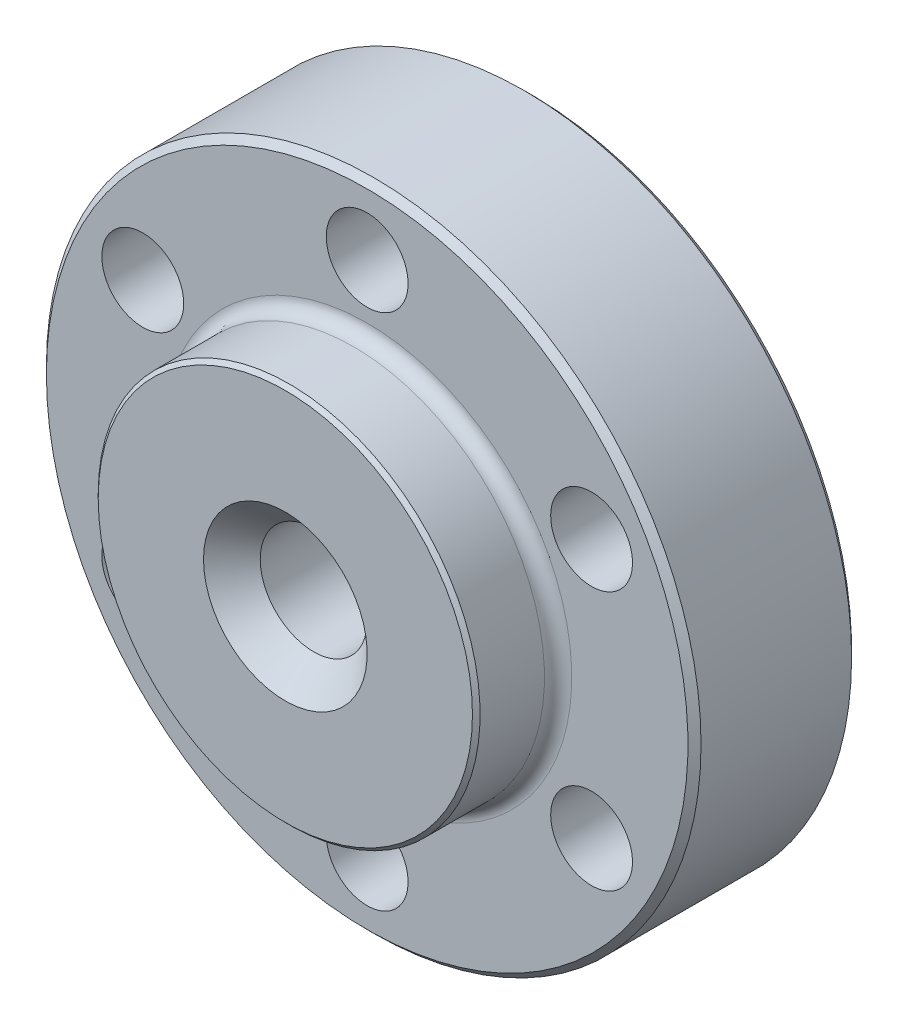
ISO-10303-21;
HEADER;
FILE_DESCRIPTION(('STEP AP214'),'2;1');
FILE_NAME('part.step','',(''),(''),'','','');
FILE_SCHEMA(('AUTOMOTIVE_DESIGN { 1 0 10303 214 1 1 1 1 }'));
ENDSEC;
DATA;
#1=APPLICATION_CONTEXT('core data for automotive mechanical design processes');
#2=APPLICATION_PROTOCOL_DEFINITION('international standard','automotive_design',2000,#1);
#3=PRODUCT_CONTEXT('',#1,'mechanical');
#4=PRODUCT('Part','Part','',(#3));
#5=PRODUCT_RELATED_PRODUCT_CATEGORY('part','',(#4));
#6=PRODUCT_DEFINITION_FORMATION('','',#4);
#7=PRODUCT_DEFINITION_CONTEXT('part definition',#1,'design');
#8=PRODUCT_DEFINITION('design','',#6,#7);
#9=PRODUCT_DEFINITION_SHAPE('','',#8);
#10=(LENGTH_UNIT() NAMED_UNIT(*) SI_UNIT(.MILLI.,.METRE.));
#11=(NAMED_UNIT(*) PLANE_ANGLE_UNIT() SI_UNIT($,.RADIAN.));
#12=(NAMED_UNIT(*) SI_UNIT($,.STERADIAN.) SOLID_ANGLE_UNIT());
#13=UNCERTAINTY_MEASURE_WITH_UNIT(LENGTH_MEASURE(1.E-05),#10,'distance_accuracy_value','');
#14=(GEOMETRIC_REPRESENTATION_CONTEXT(3) GLOBAL_UNCERTAINTY_ASSIGNED_CONTEXT((#13)) GLOBAL_UNIT_ASSIGNED_CONTEXT((#10,
#11,#12)) REPRESENTATION_CONTEXT('',''));
#15=CARTESIAN_POINT('',(0.,0.,0.));
#16=DIRECTION('',(0.,0.,1.));
#17=DIRECTION('',(1.,0.,0.));
#18=AXIS2_PLACEMENT_3D('',#15,#16,#17);
#19=CARTESIAN_POINT('',(0.,23.52,0.));
#20=DIRECTION('',(0.,0.,1.));
#21=DIRECTION('',(1.,0.,0.));
#22=AXIS2_PLACEMENT_3D('',#19,#20,#21);
#23=PLANE('',#22);
#24=CARTESIAN_POINT('',(16.4544826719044,9.5,0.));
#25=DIRECTION('',(0.,0.,1.));
#26=DIRECTION('',(1.,0.,0.));
#27=AXIS2_PLACEMENT_3D('',#24,#25,#26);
#28=CIRCLE('',#27,3.);
#29=CARTESIAN_POINT('',(19.4544826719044,9.5,0.));
#30=VERTEX_POINT('',#29);
#31=EDGE_CURVE('E58',#30,#30,#28,.T.);
#32=ORIENTED_EDGE('',*,*,#31,.T.);
#33=EDGE_LOOP('',(#32));
#34=FACE_BOUND('',#33,.T.);
#35=CARTESIAN_POINT('',(16.4544826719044,-9.5,0.));
#36=DIRECTION('',(0.,0.,1.));
#37=DIRECTION('',(1.,0.,0.));
#38=AXIS2_PLACEMENT_3D('',#35,#36,#37);
#39=CIRCLE('',#38,3.);
#40=CARTESIAN_POINT('',(19.4544826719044,-9.5,0.));
#41=VERTEX_POINT('',#40);
#42=EDGE_CURVE('E54',#41,#41,#39,.T.);
#43=ORIENTED_EDGE('',*,*,#42,.T.);
#44=EDGE_LOOP('',(#43));
#45=FACE_BOUND('',#44,.T.);
#46=CARTESIAN_POINT('',(0.,-19.,0.));
#47=DIRECTION('',(0.,0.,1.));
#48=DIRECTION('',(1.,0.,0.));
#49=AXIS2_PLACEMENT_3D('',#46,#47,#48);
#50=CIRCLE('',#49,3.);
#51=CARTESIAN_POINT('',(3.,-19.,0.));
#52=VERTEX_POINT('',#51);
#53=EDGE_CURVE('E50',#52,#52,#50,.T.);
#54=ORIENTED_EDGE('',*,*,#53,.T.);
#55=EDGE_LOOP('',(#54));
#56=FACE_BOUND('',#55,.T.);
#57=CARTESIAN_POINT('',(-16.4544826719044,-9.5,0.));
#58=DIRECTION('',(0.,0.,1.));
#59=DIRECTION('',(1.,0.,0.));
#60=AXIS2_PLACEMENT_3D('',#57,#58,#59);
#61=CIRCLE('',#60,3.);
#62=CARTESIAN_POINT('',(-13.4544826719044,-9.5,0.));
#63=VERTEX_POINT('',#62);
#64=EDGE_CURVE('E45',#63,#63,#61,.T.);
#65=ORIENTED_EDGE('',*,*,#64,.T.);
#66=EDGE_LOOP('',(#65));
#67=FACE_BOUND('',#66,.T.);
#68=CARTESIAN_POINT('',(-16.4544826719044,9.5,0.));
#69=DIRECTION('',(0.,0.,1.));
#70=DIRECTION('',(1.,0.,0.));
#71=AXIS2_PLACEMENT_3D('',#68,#69,#70);
#72=CIRCLE('',#71,3.);
#73=CARTESIAN_POINT('',(-13.4544826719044,9.5,0.));
#74=VERTEX_POINT('',#73);
#75=EDGE_CURVE('E40',#74,#74,#72,.T.);
#76=ORIENTED_EDGE('',*,*,#75,.T.);
#77=EDGE_LOOP('',(#76));
#78=FACE_BOUND('',#77,.T.);
#79=CARTESIAN_POINT('',(0.,19.,0.));
#80=DIRECTION('',(0.,0.,1.));
#81=DIRECTION('',(1.,0.,0.));
#82=AXIS2_PLACEMENT_3D('',#79,#80,#81);
#83=CIRCLE('',#82,3.);
#84=CARTESIAN_POINT('',(3.,19.,0.));
#85=VERTEX_POINT('',#84);
#86=EDGE_CURVE('E39',#85,#85,#83,.T.);
#87=ORIENTED_EDGE('',*,*,#86,.T.);
#88=EDGE_LOOP('',(#87));
#89=FACE_BOUND('',#88,.T.);
#90=CARTESIAN_POINT('',(0.,0.,0.));
#91=DIRECTION('',(0.,0.,-1.));
#92=DIRECTION('',(-1.,0.,0.));
#93=AXIS2_PLACEMENT_3D('',#90,#91,#92);
#94=CIRCLE('',#93,23.52);
#95=CARTESIAN_POINT('',(-23.52,0.,0.));
#96=VERTEX_POINT('',#95);
#97=EDGE_CURVE('E8',#96,#96,#94,.T.);
#98=ORIENTED_EDGE('',*,*,#97,.T.);
#99=EDGE_LOOP('',(#98));
#100=FACE_BOUND('',#99,.T.);
#101=CARTESIAN_POINT('',(0.,0.,0.));
#102=DIRECTION('',(0.,0.,-1.));
#103=DIRECTION('',(-1.,0.,0.));
#104=AXIS2_PLACEMENT_3D('',#101,#102,#103);
#105=CIRCLE('',#104,6.);
#106=CARTESIAN_POINT('',(-6.,0.,0.));
#107=VERTEX_POINT('',#106);
#108=EDGE_CURVE('E86',#107,#107,#105,.T.);
#109=ORIENTED_EDGE('',*,*,#108,.F.);
#110=EDGE_LOOP('',(#109));
#111=FACE_BOUND('',#110,.T.);
#112=ADVANCED_FACE('F12',(#34,#45,#56,#67,#78,#89,#100,#111),#23,.F.);
#113=CARTESIAN_POINT('',(0.,0.,18.));
#114=DIRECTION('',(0.,0.,-1.));
#115=DIRECTION('',(-1.,0.,0.));
#116=AXIS2_PLACEMENT_3D('',#113,#114,#115);
#117=PLANE('',#116);
#118=CARTESIAN_POINT('',(0.,0.,18.));
#119=DIRECTION('',(0.,0.,-1.));
#120=DIRECTION('',(-1.,0.,0.));
#121=AXIS2_PLACEMENT_3D('',#118,#119,#120);
#122=CIRCLE('',#121,13.72);
#123=CARTESIAN_POINT('',(-13.72,0.,18.));
#124=VERTEX_POINT('',#123);
#125=EDGE_CURVE('E21',#124,#124,#122,.T.);
#126=ORIENTED_EDGE('',*,*,#125,.F.);
#127=EDGE_LOOP('',(#126));
#128=FACE_BOUND('',#127,.T.);
#129=CARTESIAN_POINT('',(0.,0.,18.));
#130=DIRECTION('',(0.,0.,-1.));
#131=DIRECTION('',(-1.,0.,0.));
#132=AXIS2_PLACEMENT_3D('',#129,#130,#131);
#133=CIRCLE('',#132,6.);
#134=CARTESIAN_POINT('',(-6.,0.,18.));
#135=VERTEX_POINT('',#134);
#136=EDGE_CURVE('E97',#135,#135,#133,.T.);
#137=ORIENTED_EDGE('',*,*,#136,.T.);
#138=EDGE_LOOP('',(#137));
#139=FACE_BOUND('',#138,.T.);
#140=ADVANCED_FACE('F135',(#128,#139),#117,.F.);
#141=CARTESIAN_POINT('',(0.,0.,0.48));
#142=DIRECTION('',(0.,0.,1.));
#143=DIRECTION('',(1.,0.,0.));
#144=AXIS2_PLACEMENT_3D('',#141,#142,#143);
#145=CONICAL_SURFACE('',#144,24.,0.785398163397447);
#146=ORIENTED_EDGE('',*,*,#97,.F.);
#147=EDGE_LOOP('',(#146));
#148=FACE_BOUND('',#147,.T.);
#149=CARTESIAN_POINT('',(0.,0.,0.48));
#150=DIRECTION('',(0.,0.,-1.));
#151=DIRECTION('',(-1.,0.,0.));
#152=AXIS2_PLACEMENT_3D('',#149,#150,#151);
#153=CIRCLE('',#152,24.);
#154=CARTESIAN_POINT('',(-24.,0.,0.480000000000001));
#155=VERTEX_POINT('',#154);
#156=EDGE_CURVE('E101',#155,#155,#153,.T.);
#157=ORIENTED_EDGE('',*,*,#156,.T.);
#158=EDGE_LOOP('',(#157));
#159=FACE_BOUND('',#158,.T.);
#160=ADVANCED_FACE('F14',(#148,#159),#145,.T.);
#161=CARTESIAN_POINT('',(0.,0.,18.));
#162=DIRECTION('',(0.,0.,-1.));
#163=DIRECTION('',(-1.,0.,0.));
#164=AXIS2_PLACEMENT_3D('',#161,#162,#163);
#165=CONICAL_SURFACE('',#164,13.72,0.785398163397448);
#166=CARTESIAN_POINT('',(0.,0.,17.72));
#167=DIRECTION('',(0.,0.,-1.));
#168=DIRECTION('',(-1.,0.,0.));
#169=AXIS2_PLACEMENT_3D('',#166,#167,#168);
#170=CIRCLE('',#169,14.);
#171=CARTESIAN_POINT('',(-14.,0.,17.72));
#172=VERTEX_POINT('',#171);
#173=EDGE_CURVE('E31',#172,#172,#170,.T.);
#174=ORIENTED_EDGE('',*,*,#173,.F.);
#175=EDGE_LOOP('',(#174));
#176=FACE_BOUND('',#175,.T.);
#177=ORIENTED_EDGE('',*,*,#125,.T.);
#178=EDGE_LOOP('',(#177));
#179=FACE_BOUND('',#178,.T.);
#180=ADVANCED_FACE('F129',(#176,#179),#165,.T.);
#181=CARTESIAN_POINT('',(0.,0.,0.));
#182=DIRECTION('',(0.,0.,-1.));
#183=DIRECTION('',(-1.,0.,0.));
#184=AXIS2_PLACEMENT_3D('',#181,#182,#183);
#185=CYLINDRICAL_SURFACE('',#184,14.);
#186=CARTESIAN_POINT('',(0.,0.,13.));
#187=DIRECTION('',(0.,0.,-1.));
#188=DIRECTION('',(-1.,0.,0.));
#189=AXIS2_PLACEMENT_3D('',#186,#187,#188);
#190=CIRCLE('',#189,14.);
#191=CARTESIAN_POINT('',(-14.,0.,13.));
#192=VERTEX_POINT('',#191);
#193=EDGE_CURVE('E117',#192,#192,#190,.T.);
#194=ORIENTED_EDGE('',*,*,#193,.F.);
#195=EDGE_LOOP('',(#194));
#196=FACE_BOUND('',#195,.T.);
#197=ORIENTED_EDGE('',*,*,#173,.T.);
#198=EDGE_LOOP('',(#197));
#199=FACE_BOUND('',#198,.T.);
#200=ADVANCED_FACE('F127',(#196,#199),#185,.T.);
#201=CARTESIAN_POINT('',(0.,0.,13.));
#202=DIRECTION('',(0.,0.,-1.));
#203=DIRECTION('',(-1.,0.,0.));
#204=AXIS2_PLACEMENT_3D('',#201,#202,#203);
#205=TOROIDAL_SURFACE('',#204,15.,1.);
#206=ORIENTED_EDGE('',*,*,#193,.T.);
#207=EDGE_LOOP('',(#206));
#208=FACE_BOUND('',#207,.T.);
#209=CARTESIAN_POINT('',(0.,0.,12.));
#210=DIRECTION('',(0.,0.,-1.));
#211=DIRECTION('',(-1.,0.,0.));
#212=AXIS2_PLACEMENT_3D('',#209,#210,#211);
#213=CIRCLE('',#212,15.);
#214=CARTESIAN_POINT('',(-15.,0.,12.));
#215=VERTEX_POINT('',#214);
#216=EDGE_CURVE('E113',#215,#215,#213,.T.);
#217=ORIENTED_EDGE('',*,*,#216,.F.);
#218=EDGE_LOOP('',(#217));
#219=FACE_BOUND('',#218,.T.);
#220=ADVANCED_FACE('F165',(#208,#219),#205,.F.);
#221=CARTESIAN_POINT('',(0.,15.,12.));
#222=DIRECTION('',(0.,0.,-1.));
#223=DIRECTION('',(-1.,0.,0.));
#224=AXIS2_PLACEMENT_3D('',#221,#222,#223);
#225=PLANE('',#224);
#226=CARTESIAN_POINT('',(16.4544826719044,9.5,12.));
#227=DIRECTION('',(0.,0.,-1.));
#228=DIRECTION('',(-1.,0.,0.));
#229=AXIS2_PLACEMENT_3D('',#226,#227,#228);
#230=CIRCLE('',#229,3.);
#231=CARTESIAN_POINT('',(13.4544826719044,9.5,12.));
#232=VERTEX_POINT('',#231);
#233=EDGE_CURVE('E16',#232,#232,#230,.T.);
#234=ORIENTED_EDGE('',*,*,#233,.T.);
#235=EDGE_LOOP('',(#234));
#236=FACE_BOUND('',#235,.T.);
#237=CARTESIAN_POINT('',(16.4544826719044,-9.5,12.));
#238=DIRECTION('',(0.,0.,-1.));
#239=DIRECTION('',(-1.,0.,0.));
#240=AXIS2_PLACEMENT_3D('',#237,#238,#239);
#241=CIRCLE('',#240,3.);
#242=CARTESIAN_POINT('',(13.4544826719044,-9.5,12.));
#243=VERTEX_POINT('',#242);
#244=EDGE_CURVE('E55',#243,#243,#241,.T.);
#245=ORIENTED_EDGE('',*,*,#244,.T.);
#246=EDGE_LOOP('',(#245));
#247=FACE_BOUND('',#246,.T.);
#248=CARTESIAN_POINT('',(0.,-19.,12.));
#249=DIRECTION('',(0.,0.,-1.));
#250=DIRECTION('',(-1.,0.,0.));
#251=AXIS2_PLACEMENT_3D('',#248,#249,#250);
#252=CIRCLE('',#251,3.);
#253=CARTESIAN_POINT('',(-3.,-19.,12.));
#254=VERTEX_POINT('',#253);
#255=EDGE_CURVE('E51',#254,#254,#252,.T.);
#256=ORIENTED_EDGE('',*,*,#255,.T.);
#257=EDGE_LOOP('',(#256));
#258=FACE_BOUND('',#257,.T.);
#259=CARTESIAN_POINT('',(-16.4544826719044,-9.5,12.));
#260=DIRECTION('',(0.,0.,-1.));
#261=DIRECTION('',(-1.,0.,0.));
#262=AXIS2_PLACEMENT_3D('',#259,#260,#261);
#263=CIRCLE('',#262,3.);
#264=CARTESIAN_POINT('',(-19.4544826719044,-9.5,12.));
#265=VERTEX_POINT('',#264);
#266=EDGE_CURVE('E46',#265,#265,#263,.T.);
#267=ORIENTED_EDGE('',*,*,#266,.T.);
#268=EDGE_LOOP('',(#267));
#269=FACE_BOUND('',#268,.T.);
#270=CARTESIAN_POINT('',(-16.4544826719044,9.5,12.));
#271=DIRECTION('',(0.,0.,-1.));
#272=DIRECTION('',(-1.,0.,0.));
#273=AXIS2_PLACEMENT_3D('',#270,#271,#272);
#274=CIRCLE('',#273,3.);
#275=CARTESIAN_POINT('',(-19.4544826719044,9.5,12.));
#276=VERTEX_POINT('',#275);
#277=EDGE_CURVE('E41',#276,#276,#274,.T.);
#278=ORIENTED_EDGE('',*,*,#277,.T.);
#279=EDGE_LOOP('',(#278));
#280=FACE_BOUND('',#279,.T.);
#281=CARTESIAN_POINT('',(0.,19.,12.));
#282=DIRECTION('',(0.,0.,-1.));
#283=DIRECTION('',(-1.,0.,0.));
#284=AXIS2_PLACEMENT_3D('',#281,#282,#283);
#285=CIRCLE('',#284,3.);
#286=CARTESIAN_POINT('',(-3.,19.,12.));
#287=VERTEX_POINT('',#286);
#288=EDGE_CURVE('E35',#287,#287,#285,.T.);
#289=ORIENTED_EDGE('',*,*,#288,.T.);
#290=EDGE_LOOP('',(#289));
#291=FACE_BOUND('',#290,.T.);
#292=CARTESIAN_POINT('',(0.,0.,12.));
#293=DIRECTION('',(0.,0.,-1.));
#294=DIRECTION('',(-1.,0.,0.));
#295=AXIS2_PLACEMENT_3D('',#292,#293,#294);
#296=CIRCLE('',#295,23.52);
#297=CARTESIAN_POINT('',(-23.52,0.,12.));
#298=VERTEX_POINT('',#297);
#299=EDGE_CURVE('E109',#298,#298,#296,.T.);
#300=ORIENTED_EDGE('',*,*,#299,.F.);
#301=EDGE_LOOP('',(#300));
#302=FACE_BOUND('',#301,.T.);
#303=ORIENTED_EDGE('',*,*,#216,.T.);
#304=EDGE_LOOP('',(#303));
#305=FACE_BOUND('',#304,.T.);
#306=ADVANCED_FACE('F169',(#236,#247,#258,#269,#280,#291,#302,#305),#225,.F.);
#307=CARTESIAN_POINT('',(0.,0.,12.));
#308=DIRECTION('',(0.,0.,-1.));
#309=DIRECTION('',(-1.,0.,0.));
#310=AXIS2_PLACEMENT_3D('',#307,#308,#309);
#311=CONICAL_SURFACE('',#310,23.52,0.785398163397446);
#312=CARTESIAN_POINT('',(0.,0.,11.52));
#313=DIRECTION('',(0.,0.,-1.));
#314=DIRECTION('',(-1.,0.,0.));
#315=AXIS2_PLACEMENT_3D('',#312,#313,#314);
#316=CIRCLE('',#315,24.);
#317=CARTESIAN_POINT('',(-24.,0.,11.52));
#318=VERTEX_POINT('',#317);
#319=EDGE_CURVE('E105',#318,#318,#316,.T.);
#320=ORIENTED_EDGE('',*,*,#319,.F.);
#321=EDGE_LOOP('',(#320));
#322=FACE_BOUND('',#321,.T.);
#323=ORIENTED_EDGE('',*,*,#299,.T.);
#324=EDGE_LOOP('',(#323));
#325=FACE_BOUND('',#324,.T.);
#326=ADVANCED_FACE('F155',(#322,#325),#311,.T.);
#327=CARTESIAN_POINT('',(0.,0.,0.));
#328=DIRECTION('',(0.,0.,-1.));
#329=DIRECTION('',(-1.,0.,0.));
#330=AXIS2_PLACEMENT_3D('',#327,#328,#329);
#331=CYLINDRICAL_SURFACE('',#330,24.);
#332=ORIENTED_EDGE('',*,*,#156,.F.);
#333=EDGE_LOOP('',(#332));
#334=FACE_BOUND('',#333,.T.);
#335=ORIENTED_EDGE('',*,*,#319,.T.);
#336=EDGE_LOOP('',(#335));
#337=FACE_BOUND('',#336,.T.);
#338=ADVANCED_FACE('F144',(#334,#337),#331,.T.);
#339=CARTESIAN_POINT('',(0.,0.,18.));
#340=DIRECTION('',(0.,0.,1.));
#341=DIRECTION('',(1.,0.,0.));
#342=AXIS2_PLACEMENT_3D('',#339,#340,#341);
#343=CONICAL_SURFACE('',#342,6.,0.785398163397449);
#344=CARTESIAN_POINT('',(0.,0.,15.92));
#345=DIRECTION('',(0.,0.,-1.));
#346=DIRECTION('',(-1.,0.,0.));
#347=AXIS2_PLACEMENT_3D('',#344,#345,#346);
#348=CIRCLE('',#347,3.92);
#349=CARTESIAN_POINT('',(-3.92,0.,15.92));
#350=VERTEX_POINT('',#349);
#351=EDGE_CURVE('E93',#350,#350,#348,.T.);
#352=ORIENTED_EDGE('',*,*,#351,.T.);
#353=EDGE_LOOP('',(#352));
#354=FACE_BOUND('',#353,.T.);
#355=ORIENTED_EDGE('',*,*,#136,.F.);
#356=EDGE_LOOP('',(#355));
#357=FACE_BOUND('',#356,.T.);
#358=ADVANCED_FACE('F141',(#354,#357),#343,.F.);
#359=CARTESIAN_POINT('',(0.,0.,-1.));
#360=DIRECTION('',(0.,0.,-1.));
#361=DIRECTION('',(-1.,0.,0.));
#362=AXIS2_PLACEMENT_3D('',#359,#360,#361);
#363=CYLINDRICAL_SURFACE('',#362,3.92);
#364=CARTESIAN_POINT('',(0.,0.,2.08));
#365=DIRECTION('',(0.,0.,-1.));
#366=DIRECTION('',(-1.,0.,0.));
#367=AXIS2_PLACEMENT_3D('',#364,#365,#366);
#368=CIRCLE('',#367,3.92);
#369=CARTESIAN_POINT('',(-3.92,0.,2.08));
#370=VERTEX_POINT('',#369);
#371=EDGE_CURVE('E89',#370,#370,#368,.T.);
#372=ORIENTED_EDGE('',*,*,#371,.T.);
#373=EDGE_LOOP('',(#372));
#374=FACE_BOUND('',#373,.T.);
#375=ORIENTED_EDGE('',*,*,#351,.F.);
#376=EDGE_LOOP('',(#375));
#377=FACE_BOUND('',#376,.T.);
#378=ADVANCED_FACE('F143',(#374,#377),#363,.F.);
#379=CARTESIAN_POINT('',(0.,0.,2.08));
#380=DIRECTION('',(0.,0.,-1.));
#381=DIRECTION('',(-1.,0.,0.));
#382=AXIS2_PLACEMENT_3D('',#379,#380,#381);
#383=CONICAL_SURFACE('',#382,3.92,0.785398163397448);
#384=ORIENTED_EDGE('',*,*,#108,.T.);
#385=EDGE_LOOP('',(#384));
#386=FACE_BOUND('',#385,.T.);
#387=ORIENTED_EDGE('',*,*,#371,.F.);
#388=EDGE_LOOP('',(#387));
#389=FACE_BOUND('',#388,.T.);
#390=ADVANCED_FACE('F152',(#386,#389),#383,.F.);
#391=CARTESIAN_POINT('',(0.,19.,-1.));
#392=DIRECTION('',(0.,0.,1.));
#393=DIRECTION('',(0.,-1.,0.));
#394=AXIS2_PLACEMENT_3D('',#391,#392,#393);
#395=CYLINDRICAL_SURFACE('',#394,3.);
#396=ORIENTED_EDGE('',*,*,#288,.F.);
#397=EDGE_LOOP('',(#396));
#398=FACE_BOUND('',#397,.T.);
#399=ORIENTED_EDGE('',*,*,#86,.F.);
#400=EDGE_LOOP('',(#399));
#401=FACE_BOUND('',#400,.T.);
#402=ADVANCED_FACE('F218',(#398,#401),#395,.F.);
#403=CARTESIAN_POINT('',(-16.4544826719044,9.5,-1.));
#404=DIRECTION('',(0.,0.,1.));
#405=DIRECTION('',(0.866025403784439,-0.5,0.));
#406=AXIS2_PLACEMENT_3D('',#403,#404,#405);
#407=CYLINDRICAL_SURFACE('',#406,3.);
#408=ORIENTED_EDGE('',*,*,#277,.F.);
#409=EDGE_LOOP('',(#408));
#410=FACE_BOUND('',#409,.T.);
#411=ORIENTED_EDGE('',*,*,#75,.F.);
#412=EDGE_LOOP('',(#411));
#413=FACE_BOUND('',#412,.T.);
#414=ADVANCED_FACE('F228',(#410,#413),#407,.F.);
#415=CARTESIAN_POINT('',(-16.4544826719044,-9.5,-1.));
#416=DIRECTION('',(0.,0.,1.));
#417=DIRECTION('',(0.866025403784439,0.5,0.));
#418=AXIS2_PLACEMENT_3D('',#415,#416,#417);
#419=CYLINDRICAL_SURFACE('',#418,3.);
#420=ORIENTED_EDGE('',*,*,#266,.F.);
#421=EDGE_LOOP('',(#420));
#422=FACE_BOUND('',#421,.T.);
#423=ORIENTED_EDGE('',*,*,#64,.F.);
#424=EDGE_LOOP('',(#423));
#425=FACE_BOUND('',#424,.T.);
#426=ADVANCED_FACE('F238',(#422,#425),#419,.F.);
#427=CARTESIAN_POINT('',(0.,-19.,-1.));
#428=DIRECTION('',(0.,0.,1.));
#429=DIRECTION('',(0.,1.,0.));
#430=AXIS2_PLACEMENT_3D('',#427,#428,#429);
#431=CYLINDRICAL_SURFACE('',#430,3.);
#432=ORIENTED_EDGE('',*,*,#255,.F.);
#433=EDGE_LOOP('',(#432));
#434=FACE_BOUND('',#433,.T.);
#435=ORIENTED_EDGE('',*,*,#53,.F.);
#436=EDGE_LOOP('',(#435));
#437=FACE_BOUND('',#436,.T.);
#438=ADVANCED_FACE('F248',(#434,#437),#431,.F.);
#439=CARTESIAN_POINT('',(16.4544826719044,-9.5,-1.));
#440=DIRECTION('',(0.,0.,1.));
#441=DIRECTION('',(-0.866025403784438,0.5,0.));
#442=AXIS2_PLACEMENT_3D('',#439,#440,#441);
#443=CYLINDRICAL_SURFACE('',#442,3.);
#444=ORIENTED_EDGE('',*,*,#244,.F.);
#445=EDGE_LOOP('',(#444));
#446=FACE_BOUND('',#445,.T.);
#447=ORIENTED_EDGE('',*,*,#42,.F.);
#448=EDGE_LOOP('',(#447));
#449=FACE_BOUND('',#448,.T.);
#450=ADVANCED_FACE('F258',(#446,#449),#443,.F.);
#451=CARTESIAN_POINT('',(16.4544826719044,9.5,-1.));
#452=DIRECTION('',(0.,0.,1.));
#453=DIRECTION('',(-0.866025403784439,-0.5,0.));
#454=AXIS2_PLACEMENT_3D('',#451,#452,#453);
#455=CYLINDRICAL_SURFACE('',#454,3.);
#456=ORIENTED_EDGE('',*,*,#233,.F.);
#457=EDGE_LOOP('',(#456));
#458=FACE_BOUND('',#457,.T.);
#459=ORIENTED_EDGE('',*,*,#31,.F.);
#460=EDGE_LOOP('',(#459));
#461=FACE_BOUND('',#460,.T.);
#462=ADVANCED_FACE('F268',(#458,#461),#455,.F.);
#463=CLOSED_SHELL('',(#112,#140,#160,#180,#200,#220,#306,#326,#338,#358,#378,#390,#402,#414,
#426,#438,#450,#462));
#464=MANIFOLD_SOLID_BREP('B1',#463);
#465=ADVANCED_BREP_SHAPE_REPRESENTATION('',(#18,#464),#14);
#466=SHAPE_DEFINITION_REPRESENTATION(#9,#465);
ENDSEC;
END-ISO-10303-21;
